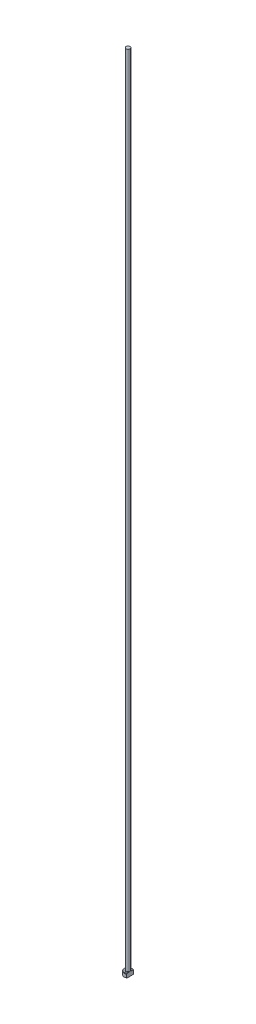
from build123d import *
from build123d.topology import SkipClean

# Parameters (mm, degrees)
CHAMFER1_SIZE = 0.2
FILLET1_R     = 0.2
KEY_DEPTH     = 401.009999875


with BuildPart() as part:
    # Sketch1 → Revolve1 (revolve)
    with BuildSketch(Plane.XY, mode=Mode.PRIVATE) as revolve1_sk:
        Polygon((0, 0), (-2, 0), (-2, 2), (-1, 2), (-1, 400), (0, 400), align=None)
    revolve(revolve1_sk.sketch.rotate(Axis((0, 259.958771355, 0), (0, -1, 0)), 270), axis=Axis((0, 259.958771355, 0), (0, -1, 0)))

    # Chamfer1
    chamfer1_edges = [part.edges().sort_by_distance(p)[0] for p in [
        (0, 2, -2),
        (0, 0, -2),
    ]]
    chamfer(chamfer1_edges, length=CHAMFER1_SIZE)

    # Fillet1
    fillet1_edges = [part.edges().sort_by_distance(p)[0] for p in [
        (0, 2, -1),
    ]]
    fillet(fillet1_edges, radius=FILLET1_R)

    # Sketch2 → KEY (cut, through all)
    with SkipClean():  # the faces are left unmerged after this step: merging them gives an invalid solid
        with BuildSketch(Plane(origin=(0, 0, 0), x_dir=(1, 0, 0), z_dir=(0, 1, 0))):
            with BuildLine():
                Line((1, 1.732050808), (1, -1.732050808))
                ThreePointArc((1, -1.732050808), (2, 0), (1, 1.732050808))
            make_face()
        extrude(amount=KEY_DEPTH, mode=Mode.SUBTRACT)


solid = part.part
